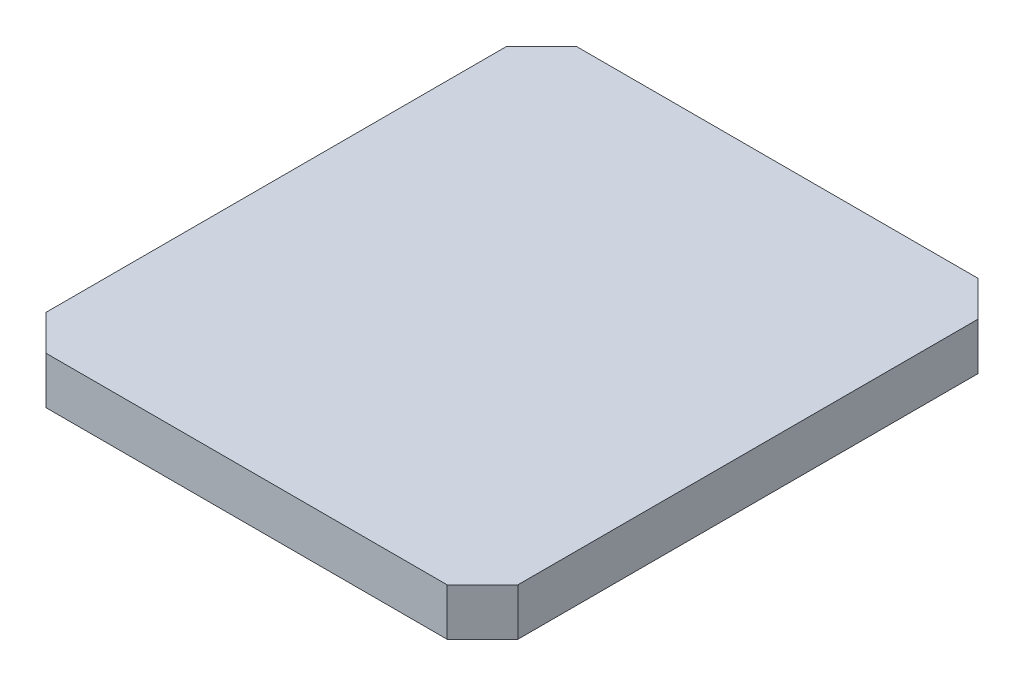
from build123d import *

# Parameters (mm, degrees)
SKETCH1_W                                = 1016
SKETCH1_H                                = 1143
BOSS_EXTRUDE1_DEPTH                      = 101.6
CUT_EXTRUDE1_DEPTH                       = 772.361659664
MIRROR1_AT_THE_SECOND_PLANE_COPY_1_DEPTH = 772.361659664


with BuildPart() as part:
    # Sketch1 → Boss-Extrude1 (new body)
    with BuildSketch(Plane(origin=(0, 0, 0), x_dir=(1, 0, 0), z_dir=(0, 1, 0))):
        Rectangle(SKETCH1_W, SKETCH1_H)
    extrude(amount=BOSS_EXTRUDE1_DEPTH)

    # Sketch2 → Cut-Extrude1 (cut, symmetric)
    with BuildSketch(Plane(origin=(0, 0, 0), x_dir=(1, 0, 0), z_dir=(0, 1, 0))):
        Polygon((-508, 495.3), (-431.8, 571.5), (-431.8, 596.9), (-533.4, 596.9), (-533.4, 495.3), align=None)
    cut_extrude1 = extrude(amount=CUT_EXTRUDE1_DEPTH, both=True, mode=Mode.SUBTRACT)

    # Mirror1: Cut-Extrude1 across plane
    add(cut_extrude1.mirror(Plane.XY), mode=Mode.SUBTRACT)

    # Mirror1 at the second plane: Cut-Extrude1 across plane
    add(cut_extrude1.mirror(Plane(origin=(0, 0, 0), x_dir=(0, 0, 1), z_dir=(1, 0, 0))), mode=Mode.SUBTRACT)

    # Mirror1 at the second plane copy 1 sketc → Mirror1 at the second plane copy 1 (cut, symmetric)
    with BuildSketch(Plane(origin=(0, 0, 0), x_dir=(-1, 0, 0), z_dir=(0, 1, 0))):
        Polygon((-508, 495.3), (-431.8, 571.5), (-431.8, 596.9), (-533.4, 596.9), (-533.4, 495.3), align=None)
    extrude(amount=MIRROR1_AT_THE_SECOND_PLANE_COPY_1_DEPTH, both=True, mode=Mode.SUBTRACT)


solid = part.part
